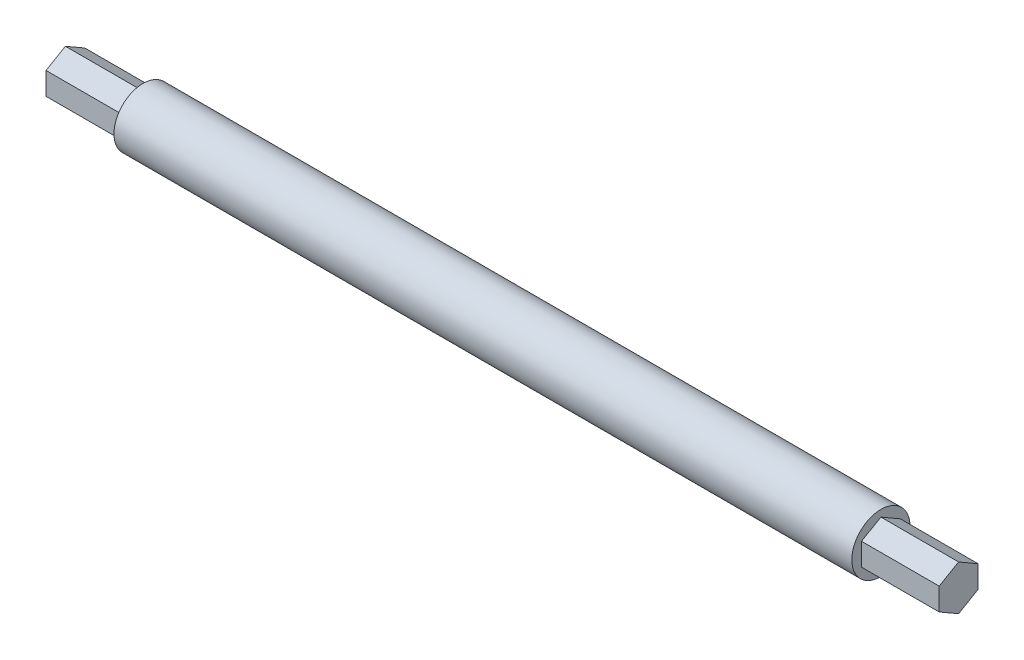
ISO-10303-21;
HEADER;
FILE_DESCRIPTION(('STEP AP214'),'2;1');
FILE_NAME('part.step','',(''),(''),'','','');
FILE_SCHEMA(('AUTOMOTIVE_DESIGN { 1 0 10303 214 1 1 1 1 }'));
ENDSEC;
DATA;
#1=APPLICATION_CONTEXT('core data for automotive mechanical design processes');
#2=APPLICATION_PROTOCOL_DEFINITION('international standard','automotive_design',2000,#1);
#3=PRODUCT_CONTEXT('',#1,'mechanical');
#4=PRODUCT('Part','Part','',(#3));
#5=PRODUCT_RELATED_PRODUCT_CATEGORY('part','',(#4));
#6=PRODUCT_DEFINITION_FORMATION('','',#4);
#7=PRODUCT_DEFINITION_CONTEXT('part definition',#1,'design');
#8=PRODUCT_DEFINITION('design','',#6,#7);
#9=PRODUCT_DEFINITION_SHAPE('','',#8);
#10=(LENGTH_UNIT() NAMED_UNIT(*) SI_UNIT(.MILLI.,.METRE.));
#11=(NAMED_UNIT(*) PLANE_ANGLE_UNIT() SI_UNIT($,.RADIAN.));
#12=(NAMED_UNIT(*) SI_UNIT($,.STERADIAN.) SOLID_ANGLE_UNIT());
#13=UNCERTAINTY_MEASURE_WITH_UNIT(LENGTH_MEASURE(1.E-05),#10,'distance_accuracy_value','');
#14=(GEOMETRIC_REPRESENTATION_CONTEXT(3) GLOBAL_UNCERTAINTY_ASSIGNED_CONTEXT((#13)) GLOBAL_UNIT_ASSIGNED_CONTEXT((#10,
#11,#12)) REPRESENTATION_CONTEXT('',''));
#15=CARTESIAN_POINT('',(0.,0.,0.));
#16=DIRECTION('',(0.,0.,1.));
#17=DIRECTION('',(1.,0.,0.));
#18=AXIS2_PLACEMENT_3D('',#15,#16,#17);
#19=CARTESIAN_POINT('',(190.,0.,0.));
#20=DIRECTION('',(-1.,0.,0.));
#21=DIRECTION('',(0.,0.,1.));
#22=AXIS2_PLACEMENT_3D('',#19,#20,#21);
#23=PLANE('',#22);
#24=CARTESIAN_POINT('',(190.,0.,0.));
#25=DIRECTION('',(-1.,0.,0.));
#26=DIRECTION('',(0.,0.,1.));
#27=AXIS2_PLACEMENT_3D('',#24,#25,#26);
#28=CIRCLE('',#27,15.);
#29=CARTESIAN_POINT('',(190.,0.,15.));
#30=VERTEX_POINT('',#29);
#31=EDGE_CURVE('E42',#30,#30,#28,.T.);
#32=ORIENTED_EDGE('',*,*,#31,.F.);
#33=EDGE_LOOP('',(#32));
#34=FACE_BOUND('',#33,.T.);
#35=DIRECTION('',(0.,-0.5,0.866025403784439));
#36=VECTOR('',#35,1.);
#37=CARTESIAN_POINT('',(190.,11.5470053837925,0.));
#38=LINE('',#37,#36);
#39=CARTESIAN_POINT('',(190.,11.5470053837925,0.));
#40=VERTEX_POINT('',#39);
#41=CARTESIAN_POINT('',(190.,5.77350269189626,10.));
#42=VERTEX_POINT('',#41);
#43=EDGE_CURVE('E49',#40,#42,#38,.T.);
#44=ORIENTED_EDGE('',*,*,#43,.F.);
#45=DIRECTION('',(0.,0.5,0.866025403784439));
#46=VECTOR('',#45,1.);
#47=CARTESIAN_POINT('',(190.,5.77350269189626,-10.));
#48=LINE('',#47,#46);
#49=CARTESIAN_POINT('',(190.,5.77350269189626,-10.));
#50=VERTEX_POINT('',#49);
#51=EDGE_CURVE('E53',#50,#40,#48,.T.);
#52=ORIENTED_EDGE('',*,*,#51,.F.);
#53=DIRECTION('',(0.,1.,0.));
#54=VECTOR('',#53,1.);
#55=CARTESIAN_POINT('',(190.,-5.77350269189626,-10.));
#56=LINE('',#55,#54);
#57=CARTESIAN_POINT('',(190.,-5.77350269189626,-10.));
#58=VERTEX_POINT('',#57);
#59=EDGE_CURVE('E365',#58,#50,#56,.T.);
#60=ORIENTED_EDGE('',*,*,#59,.F.);
#61=DIRECTION('',(0.,0.5,-0.866025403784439));
#62=VECTOR('',#61,1.);
#63=CARTESIAN_POINT('',(190.,-11.5470053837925,0.));
#64=LINE('',#63,#62);
#65=CARTESIAN_POINT('',(190.,-11.5470053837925,0.));
#66=VERTEX_POINT('',#65);
#67=EDGE_CURVE('E380',#66,#58,#64,.T.);
#68=ORIENTED_EDGE('',*,*,#67,.F.);
#69=DIRECTION('',(0.,-0.5,-0.866025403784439));
#70=VECTOR('',#69,1.);
#71=CARTESIAN_POINT('',(190.,-5.77350269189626,10.));
#72=LINE('',#71,#70);
#73=CARTESIAN_POINT('',(190.,-5.77350269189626,10.));
#74=VERTEX_POINT('',#73);
#75=EDGE_CURVE('E383',#74,#66,#72,.T.);
#76=ORIENTED_EDGE('',*,*,#75,.F.);
#77=DIRECTION('',(0.,-1.,0.));
#78=VECTOR('',#77,1.);
#79=CARTESIAN_POINT('',(190.,5.77350269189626,10.));
#80=LINE('',#79,#78);
#81=EDGE_CURVE('E384',#42,#74,#80,.T.);
#82=ORIENTED_EDGE('',*,*,#81,.F.);
#83=EDGE_LOOP('',(#44,#52,#60,#68,#76,#82));
#84=FACE_BOUND('',#83,.T.);
#85=ADVANCED_FACE('F35',(#34,#84),#23,.F.);
#86=CARTESIAN_POINT('',(-190.,0.,0.));
#87=DIRECTION('',(1.,0.,0.));
#88=DIRECTION('',(0.,0.,-1.));
#89=AXIS2_PLACEMENT_3D('',#86,#87,#88);
#90=PLANE('',#89);
#91=CARTESIAN_POINT('',(-190.,0.,0.));
#92=DIRECTION('',(-1.,0.,0.));
#93=DIRECTION('',(0.,0.,1.));
#94=AXIS2_PLACEMENT_3D('',#91,#92,#93);
#95=CIRCLE('',#94,15.);
#96=CARTESIAN_POINT('',(-190.,0.,15.));
#97=VERTEX_POINT('',#96);
#98=EDGE_CURVE('E11',#97,#97,#95,.T.);
#99=ORIENTED_EDGE('',*,*,#98,.T.);
#100=EDGE_LOOP('',(#99));
#101=FACE_BOUND('',#100,.T.);
#102=DIRECTION('',(0.,0.5,-0.866025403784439));
#103=VECTOR('',#102,1.);
#104=CARTESIAN_POINT('',(-190.,5.77350269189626,10.));
#105=LINE('',#104,#103);
#106=CARTESIAN_POINT('',(-190.,5.77350269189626,10.));
#107=VERTEX_POINT('',#106);
#108=CARTESIAN_POINT('',(-190.,11.5470053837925,0.));
#109=VERTEX_POINT('',#108);
#110=EDGE_CURVE('E143',#107,#109,#105,.T.);
#111=ORIENTED_EDGE('',*,*,#110,.F.);
#112=DIRECTION('',(0.,1.,0.));
#113=VECTOR('',#112,1.);
#114=CARTESIAN_POINT('',(-190.,-5.77350269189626,10.));
#115=LINE('',#114,#113);
#116=CARTESIAN_POINT('',(-190.,-5.77350269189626,10.));
#117=VERTEX_POINT('',#116);
#118=EDGE_CURVE('E156',#117,#107,#115,.T.);
#119=ORIENTED_EDGE('',*,*,#118,.F.);
#120=DIRECTION('',(0.,0.5,0.866025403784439));
#121=VECTOR('',#120,1.);
#122=CARTESIAN_POINT('',(-190.,-11.5470053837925,0.));
#123=LINE('',#122,#121);
#124=CARTESIAN_POINT('',(-190.,-11.5470053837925,0.));
#125=VERTEX_POINT('',#124);
#126=EDGE_CURVE('E175',#125,#117,#123,.T.);
#127=ORIENTED_EDGE('',*,*,#126,.F.);
#128=DIRECTION('',(0.,-0.5,0.866025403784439));
#129=VECTOR('',#128,1.);
#130=CARTESIAN_POINT('',(-190.,-5.77350269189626,-10.));
#131=LINE('',#130,#129);
#132=CARTESIAN_POINT('',(-190.,-5.77350269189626,-10.));
#133=VERTEX_POINT('',#132);
#134=EDGE_CURVE('E172',#133,#125,#131,.T.);
#135=ORIENTED_EDGE('',*,*,#134,.F.);
#136=DIRECTION('',(0.,-1.,0.));
#137=VECTOR('',#136,1.);
#138=CARTESIAN_POINT('',(-190.,5.77350269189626,-10.));
#139=LINE('',#138,#137);
#140=CARTESIAN_POINT('',(-190.,5.77350269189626,-10.));
#141=VERTEX_POINT('',#140);
#142=EDGE_CURVE('E169',#141,#133,#139,.T.);
#143=ORIENTED_EDGE('',*,*,#142,.F.);
#144=DIRECTION('',(0.,-0.5,-0.866025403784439));
#145=VECTOR('',#144,1.);
#146=CARTESIAN_POINT('',(-190.,11.5470053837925,0.));
#147=LINE('',#146,#145);
#148=EDGE_CURVE('E146',#109,#141,#147,.T.);
#149=ORIENTED_EDGE('',*,*,#148,.F.);
#150=EDGE_LOOP('',(#111,#119,#127,#135,#143,#149));
#151=FACE_BOUND('',#150,.T.);
#152=ADVANCED_FACE('F202',(#101,#151),#90,.F.);
#153=CARTESIAN_POINT('',(-233.547445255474,0.,0.));
#154=DIRECTION('',(-1.,0.,0.));
#155=DIRECTION('',(0.,0.,1.));
#156=AXIS2_PLACEMENT_3D('',#153,#154,#155);
#157=CYLINDRICAL_SURFACE('',#156,15.);
#158=ORIENTED_EDGE('',*,*,#98,.F.);
#159=EDGE_LOOP('',(#158));
#160=FACE_BOUND('',#159,.T.);
#161=ORIENTED_EDGE('',*,*,#31,.T.);
#162=EDGE_LOOP('',(#161));
#163=FACE_BOUND('',#162,.T.);
#164=ADVANCED_FACE('F199',(#160,#163),#157,.T.);
#165=CARTESIAN_POINT('',(-230.,5.77350269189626,10.));
#166=DIRECTION('',(0.,-0.866025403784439,-0.5));
#167=DIRECTION('',(0.,0.5,-0.866025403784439));
#168=AXIS2_PLACEMENT_3D('',#165,#166,#167);
#169=PLANE('',#168);
#170=ORIENTED_EDGE('',*,*,#110,.T.);
#171=DIRECTION('',(1.,0.,0.));
#172=VECTOR('',#171,1.);
#173=CARTESIAN_POINT('',(-230.,11.5470053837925,0.));
#174=LINE('',#173,#172);
#175=CARTESIAN_POINT('',(-230.,11.5470053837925,0.));
#176=VERTEX_POINT('',#175);
#177=EDGE_CURVE('E194',#176,#109,#174,.T.);
#178=ORIENTED_EDGE('',*,*,#177,.F.);
#179=DIRECTION('',(0.,0.5,-0.866025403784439));
#180=VECTOR('',#179,1.);
#181=CARTESIAN_POINT('',(-230.,5.77350269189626,10.));
#182=LINE('',#181,#180);
#183=CARTESIAN_POINT('',(-230.,5.77350269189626,10.));
#184=VERTEX_POINT('',#183);
#185=EDGE_CURVE('E152',#184,#176,#182,.T.);
#186=ORIENTED_EDGE('',*,*,#185,.F.);
#187=DIRECTION('',(1.,0.,0.));
#188=VECTOR('',#187,1.);
#189=CARTESIAN_POINT('',(-230.,5.77350269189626,10.));
#190=LINE('',#189,#188);
#191=EDGE_CURVE('E165',#184,#107,#190,.T.);
#192=ORIENTED_EDGE('',*,*,#191,.T.);
#193=EDGE_LOOP('',(#170,#178,#186,#192));
#194=FACE_BOUND('',#193,.T.);
#195=ADVANCED_FACE('F210',(#194),#169,.F.);
#196=CARTESIAN_POINT('',(-230.,11.5470053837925,0.));
#197=DIRECTION('',(0.,-0.866025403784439,0.5));
#198=DIRECTION('',(0.,-0.5,-0.866025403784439));
#199=AXIS2_PLACEMENT_3D('',#196,#197,#198);
#200=PLANE('',#199);
#201=ORIENTED_EDGE('',*,*,#148,.T.);
#202=DIRECTION('',(1.,0.,0.));
#203=VECTOR('',#202,1.);
#204=CARTESIAN_POINT('',(-230.,5.77350269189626,-10.));
#205=LINE('',#204,#203);
#206=CARTESIAN_POINT('',(-230.,5.77350269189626,-10.));
#207=VERTEX_POINT('',#206);
#208=EDGE_CURVE('E191',#207,#141,#205,.T.);
#209=ORIENTED_EDGE('',*,*,#208,.F.);
#210=DIRECTION('',(0.,-0.5,-0.866025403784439));
#211=VECTOR('',#210,1.);
#212=CARTESIAN_POINT('',(-230.,11.5470053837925,0.));
#213=LINE('',#212,#211);
#214=EDGE_CURVE('E155',#176,#207,#213,.T.);
#215=ORIENTED_EDGE('',*,*,#214,.F.);
#216=ORIENTED_EDGE('',*,*,#177,.T.);
#217=EDGE_LOOP('',(#201,#209,#215,#216));
#218=FACE_BOUND('',#217,.T.);
#219=ADVANCED_FACE('F217',(#218),#200,.F.);
#220=CARTESIAN_POINT('',(-230.,5.77350269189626,-10.));
#221=DIRECTION('',(0.,0.,1.));
#222=DIRECTION('',(1.,0.,0.));
#223=AXIS2_PLACEMENT_3D('',#220,#221,#222);
#224=PLANE('',#223);
#225=ORIENTED_EDGE('',*,*,#142,.T.);
#226=DIRECTION('',(1.,0.,0.));
#227=VECTOR('',#226,1.);
#228=CARTESIAN_POINT('',(-230.,-5.77350269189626,-10.));
#229=LINE('',#228,#227);
#230=CARTESIAN_POINT('',(-230.,-5.77350269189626,-10.));
#231=VERTEX_POINT('',#230);
#232=EDGE_CURVE('E188',#231,#133,#229,.T.);
#233=ORIENTED_EDGE('',*,*,#232,.F.);
#234=DIRECTION('',(0.,-1.,0.));
#235=VECTOR('',#234,1.);
#236=CARTESIAN_POINT('',(-230.,5.77350269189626,-10.));
#237=LINE('',#236,#235);
#238=EDGE_CURVE('E158',#207,#231,#237,.T.);
#239=ORIENTED_EDGE('',*,*,#238,.F.);
#240=ORIENTED_EDGE('',*,*,#208,.T.);
#241=EDGE_LOOP('',(#225,#233,#239,#240));
#242=FACE_BOUND('',#241,.T.);
#243=ADVANCED_FACE('F221',(#242),#224,.F.);
#244=CARTESIAN_POINT('',(-230.,-5.77350269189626,-10.));
#245=DIRECTION('',(0.,0.866025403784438,0.5));
#246=DIRECTION('',(0.,-0.5,0.866025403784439));
#247=AXIS2_PLACEMENT_3D('',#244,#245,#246);
#248=PLANE('',#247);
#249=ORIENTED_EDGE('',*,*,#134,.T.);
#250=DIRECTION('',(1.,0.,0.));
#251=VECTOR('',#250,1.);
#252=CARTESIAN_POINT('',(-230.,-11.5470053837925,0.));
#253=LINE('',#252,#251);
#254=CARTESIAN_POINT('',(-230.,-11.5470053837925,0.));
#255=VERTEX_POINT('',#254);
#256=EDGE_CURVE('E185',#255,#125,#253,.T.);
#257=ORIENTED_EDGE('',*,*,#256,.F.);
#258=DIRECTION('',(0.,-0.5,0.866025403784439));
#259=VECTOR('',#258,1.);
#260=CARTESIAN_POINT('',(-230.,-5.77350269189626,-10.));
#261=LINE('',#260,#259);
#262=EDGE_CURVE('E160',#231,#255,#261,.T.);
#263=ORIENTED_EDGE('',*,*,#262,.F.);
#264=ORIENTED_EDGE('',*,*,#232,.T.);
#265=EDGE_LOOP('',(#249,#257,#263,#264));
#266=FACE_BOUND('',#265,.T.);
#267=ADVANCED_FACE('F225',(#266),#248,.F.);
#268=CARTESIAN_POINT('',(-230.,-11.5470053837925,0.));
#269=DIRECTION('',(0.,0.866025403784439,-0.5));
#270=DIRECTION('',(0.,0.5,0.866025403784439));
#271=AXIS2_PLACEMENT_3D('',#268,#269,#270);
#272=PLANE('',#271);
#273=ORIENTED_EDGE('',*,*,#126,.T.);
#274=DIRECTION('',(1.,0.,0.));
#275=VECTOR('',#274,1.);
#276=CARTESIAN_POINT('',(-230.,-5.77350269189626,10.));
#277=LINE('',#276,#275);
#278=CARTESIAN_POINT('',(-230.,-5.77350269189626,10.));
#279=VERTEX_POINT('',#278);
#280=EDGE_CURVE('E182',#279,#117,#277,.T.);
#281=ORIENTED_EDGE('',*,*,#280,.F.);
#282=DIRECTION('',(0.,0.5,0.866025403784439));
#283=VECTOR('',#282,1.);
#284=CARTESIAN_POINT('',(-230.,-11.5470053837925,0.));
#285=LINE('',#284,#283);
#286=EDGE_CURVE('E162',#255,#279,#285,.T.);
#287=ORIENTED_EDGE('',*,*,#286,.F.);
#288=ORIENTED_EDGE('',*,*,#256,.T.);
#289=EDGE_LOOP('',(#273,#281,#287,#288));
#290=FACE_BOUND('',#289,.T.);
#291=ADVANCED_FACE('F229',(#290),#272,.F.);
#292=CARTESIAN_POINT('',(-230.,-5.77350269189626,10.));
#293=DIRECTION('',(0.,0.,-1.));
#294=DIRECTION('',(0.,1.,0.));
#295=AXIS2_PLACEMENT_3D('',#292,#293,#294);
#296=PLANE('',#295);
#297=ORIENTED_EDGE('',*,*,#118,.T.);
#298=ORIENTED_EDGE('',*,*,#191,.F.);
#299=DIRECTION('',(0.,1.,0.));
#300=VECTOR('',#299,1.);
#301=CARTESIAN_POINT('',(-230.,-5.77350269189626,10.));
#302=LINE('',#301,#300);
#303=EDGE_CURVE('E164',#279,#184,#302,.T.);
#304=ORIENTED_EDGE('',*,*,#303,.F.);
#305=ORIENTED_EDGE('',*,*,#280,.T.);
#306=EDGE_LOOP('',(#297,#298,#304,#305));
#307=FACE_BOUND('',#306,.T.);
#308=ADVANCED_FACE('F233',(#307),#296,.F.);
#309=CARTESIAN_POINT('',(-230.,0.,0.));
#310=DIRECTION('',(-1.,0.,0.));
#311=DIRECTION('',(0.,0.,1.));
#312=AXIS2_PLACEMENT_3D('',#309,#310,#311);
#313=PLANE('',#312);
#314=ORIENTED_EDGE('',*,*,#185,.T.);
#315=ORIENTED_EDGE('',*,*,#214,.T.);
#316=ORIENTED_EDGE('',*,*,#238,.T.);
#317=ORIENTED_EDGE('',*,*,#262,.T.);
#318=ORIENTED_EDGE('',*,*,#286,.T.);
#319=ORIENTED_EDGE('',*,*,#303,.T.);
#320=EDGE_LOOP('',(#314,#315,#316,#317,#318,#319));
#321=FACE_BOUND('',#320,.T.);
#322=ADVANCED_FACE('F237',(#321),#313,.T.);
#323=CARTESIAN_POINT('',(230.,11.5470053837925,0.));
#324=DIRECTION('',(0.,-0.866025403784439,-0.5));
#325=DIRECTION('',(0.,0.5,-0.866025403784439));
#326=AXIS2_PLACEMENT_3D('',#323,#324,#325);
#327=PLANE('',#326);
#328=ORIENTED_EDGE('',*,*,#43,.T.);
#329=DIRECTION('',(-1.,0.,0.));
#330=VECTOR('',#329,1.);
#331=CARTESIAN_POINT('',(230.,5.77350269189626,10.));
#332=LINE('',#331,#330);
#333=CARTESIAN_POINT('',(230.,5.77350269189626,10.));
#334=VERTEX_POINT('',#333);
#335=EDGE_CURVE('E126',#334,#42,#332,.T.);
#336=ORIENTED_EDGE('',*,*,#335,.F.);
#337=DIRECTION('',(0.,-0.5,0.866025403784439));
#338=VECTOR('',#337,1.);
#339=CARTESIAN_POINT('',(230.,11.5470053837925,0.));
#340=LINE('',#339,#338);
#341=CARTESIAN_POINT('',(230.,11.5470053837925,0.));
#342=VERTEX_POINT('',#341);
#343=EDGE_CURVE('E132',#342,#334,#340,.T.);
#344=ORIENTED_EDGE('',*,*,#343,.F.);
#345=DIRECTION('',(-1.,0.,0.));
#346=VECTOR('',#345,1.);
#347=CARTESIAN_POINT('',(230.,11.5470053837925,0.));
#348=LINE('',#347,#346);
#349=EDGE_CURVE('E362',#342,#40,#348,.T.);
#350=ORIENTED_EDGE('',*,*,#349,.T.);
#351=EDGE_LOOP('',(#328,#336,#344,#350));
#352=FACE_BOUND('',#351,.T.);
#353=ADVANCED_FACE('F142',(#352),#327,.F.);
#354=CARTESIAN_POINT('',(230.,5.77350269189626,10.));
#355=DIRECTION('',(0.,0.,-1.));
#356=DIRECTION('',(0.,1.,0.));
#357=AXIS2_PLACEMENT_3D('',#354,#355,#356);
#358=PLANE('',#357);
#359=ORIENTED_EDGE('',*,*,#81,.T.);
#360=DIRECTION('',(-1.,0.,0.));
#361=VECTOR('',#360,1.);
#362=CARTESIAN_POINT('',(230.,-5.77350269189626,10.));
#363=LINE('',#362,#361);
#364=CARTESIAN_POINT('',(230.,-5.77350269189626,10.));
#365=VERTEX_POINT('',#364);
#366=EDGE_CURVE('E128',#365,#74,#363,.T.);
#367=ORIENTED_EDGE('',*,*,#366,.F.);
#368=DIRECTION('',(0.,-1.,0.));
#369=VECTOR('',#368,1.);
#370=CARTESIAN_POINT('',(230.,5.77350269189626,10.));
#371=LINE('',#370,#369);
#372=EDGE_CURVE('E121',#334,#365,#371,.T.);
#373=ORIENTED_EDGE('',*,*,#372,.F.);
#374=ORIENTED_EDGE('',*,*,#335,.T.);
#375=EDGE_LOOP('',(#359,#367,#373,#374));
#376=FACE_BOUND('',#375,.T.);
#377=ADVANCED_FACE('F124',(#376),#358,.F.);
#378=CARTESIAN_POINT('',(230.,-5.77350269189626,10.));
#379=DIRECTION('',(0.,0.866025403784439,-0.5));
#380=DIRECTION('',(0.,0.5,0.866025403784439));
#381=AXIS2_PLACEMENT_3D('',#378,#379,#380);
#382=PLANE('',#381);
#383=ORIENTED_EDGE('',*,*,#75,.T.);
#384=DIRECTION('',(-1.,0.,0.));
#385=VECTOR('',#384,1.);
#386=CARTESIAN_POINT('',(230.,-11.5470053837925,0.));
#387=LINE('',#386,#385);
#388=CARTESIAN_POINT('',(230.,-11.5470053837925,0.));
#389=VERTEX_POINT('',#388);
#390=EDGE_CURVE('E148',#389,#66,#387,.T.);
#391=ORIENTED_EDGE('',*,*,#390,.F.);
#392=DIRECTION('',(0.,-0.5,-0.866025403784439));
#393=VECTOR('',#392,1.);
#394=CARTESIAN_POINT('',(230.,-5.77350269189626,10.));
#395=LINE('',#394,#393);
#396=EDGE_CURVE('E131',#365,#389,#395,.T.);
#397=ORIENTED_EDGE('',*,*,#396,.F.);
#398=ORIENTED_EDGE('',*,*,#366,.T.);
#399=EDGE_LOOP('',(#383,#391,#397,#398));
#400=FACE_BOUND('',#399,.T.);
#401=ADVANCED_FACE('F246',(#400),#382,.F.);
#402=CARTESIAN_POINT('',(230.,-11.5470053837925,0.));
#403=DIRECTION('',(0.,0.866025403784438,0.5));
#404=DIRECTION('',(0.,-0.5,0.866025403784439));
#405=AXIS2_PLACEMENT_3D('',#402,#403,#404);
#406=PLANE('',#405);
#407=ORIENTED_EDGE('',*,*,#67,.T.);
#408=DIRECTION('',(-1.,0.,0.));
#409=VECTOR('',#408,1.);
#410=CARTESIAN_POINT('',(230.,-5.77350269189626,-10.));
#411=LINE('',#410,#409);
#412=CARTESIAN_POINT('',(230.,-5.77350269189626,-10.));
#413=VERTEX_POINT('',#412);
#414=EDGE_CURVE('E368',#413,#58,#411,.T.);
#415=ORIENTED_EDGE('',*,*,#414,.F.);
#416=DIRECTION('',(0.,0.5,-0.866025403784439));
#417=VECTOR('',#416,1.);
#418=CARTESIAN_POINT('',(230.,-11.5470053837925,0.));
#419=LINE('',#418,#417);
#420=EDGE_CURVE('E381',#389,#413,#419,.T.);
#421=ORIENTED_EDGE('',*,*,#420,.F.);
#422=ORIENTED_EDGE('',*,*,#390,.T.);
#423=EDGE_LOOP('',(#407,#415,#421,#422));
#424=FACE_BOUND('',#423,.T.);
#425=ADVANCED_FACE('F249',(#424),#406,.F.);
#426=CARTESIAN_POINT('',(230.,-5.77350269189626,-10.));
#427=DIRECTION('',(0.,0.,1.));
#428=DIRECTION('',(1.,0.,0.));
#429=AXIS2_PLACEMENT_3D('',#426,#427,#428);
#430=PLANE('',#429);
#431=ORIENTED_EDGE('',*,*,#59,.T.);
#432=DIRECTION('',(-1.,0.,0.));
#433=VECTOR('',#432,1.);
#434=CARTESIAN_POINT('',(230.,5.77350269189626,-10.));
#435=LINE('',#434,#433);
#436=CARTESIAN_POINT('',(230.,5.77350269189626,-10.));
#437=VERTEX_POINT('',#436);
#438=EDGE_CURVE('E364',#437,#50,#435,.T.);
#439=ORIENTED_EDGE('',*,*,#438,.F.);
#440=DIRECTION('',(0.,1.,0.));
#441=VECTOR('',#440,1.);
#442=CARTESIAN_POINT('',(230.,-5.77350269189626,-10.));
#443=LINE('',#442,#441);
#444=EDGE_CURVE('E370',#413,#437,#443,.T.);
#445=ORIENTED_EDGE('',*,*,#444,.F.);
#446=ORIENTED_EDGE('',*,*,#414,.T.);
#447=EDGE_LOOP('',(#431,#439,#445,#446));
#448=FACE_BOUND('',#447,.T.);
#449=ADVANCED_FACE('F253',(#448),#430,.F.);
#450=CARTESIAN_POINT('',(230.,5.77350269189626,-10.));
#451=DIRECTION('',(0.,-0.866025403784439,0.5));
#452=DIRECTION('',(0.,-0.5,-0.866025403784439));
#453=AXIS2_PLACEMENT_3D('',#450,#451,#452);
#454=PLANE('',#453);
#455=ORIENTED_EDGE('',*,*,#51,.T.);
#456=ORIENTED_EDGE('',*,*,#349,.F.);
#457=DIRECTION('',(0.,0.5,0.866025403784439));
#458=VECTOR('',#457,1.);
#459=CARTESIAN_POINT('',(230.,5.77350269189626,-10.));
#460=LINE('',#459,#458);
#461=EDGE_CURVE('E137',#437,#342,#460,.T.);
#462=ORIENTED_EDGE('',*,*,#461,.F.);
#463=ORIENTED_EDGE('',*,*,#438,.T.);
#464=EDGE_LOOP('',(#455,#456,#462,#463));
#465=FACE_BOUND('',#464,.T.);
#466=ADVANCED_FACE('F257',(#465),#454,.F.);
#467=CARTESIAN_POINT('',(230.,0.,0.));
#468=DIRECTION('',(1.,0.,0.));
#469=DIRECTION('',(0.,0.,-1.));
#470=AXIS2_PLACEMENT_3D('',#467,#468,#469);
#471=PLANE('',#470);
#472=ORIENTED_EDGE('',*,*,#343,.T.);
#473=ORIENTED_EDGE('',*,*,#372,.T.);
#474=ORIENTED_EDGE('',*,*,#396,.T.);
#475=ORIENTED_EDGE('',*,*,#420,.T.);
#476=ORIENTED_EDGE('',*,*,#444,.T.);
#477=ORIENTED_EDGE('',*,*,#461,.T.);
#478=EDGE_LOOP('',(#472,#473,#474,#475,#476,#477));
#479=FACE_BOUND('',#478,.T.);
#480=ADVANCED_FACE('F135',(#479),#471,.T.);
#481=CLOSED_SHELL('',(#85,#152,#164,#195,#219,#243,#267,#291,#308,#322,#353,#377,#401,#425,#449,
#466,#480));
#482=MANIFOLD_SOLID_BREP('B2',#481);
#483=ADVANCED_BREP_SHAPE_REPRESENTATION('',(#18,#482),#14);
#484=SHAPE_DEFINITION_REPRESENTATION(#9,#483);
ENDSEC;
END-ISO-10303-21;
